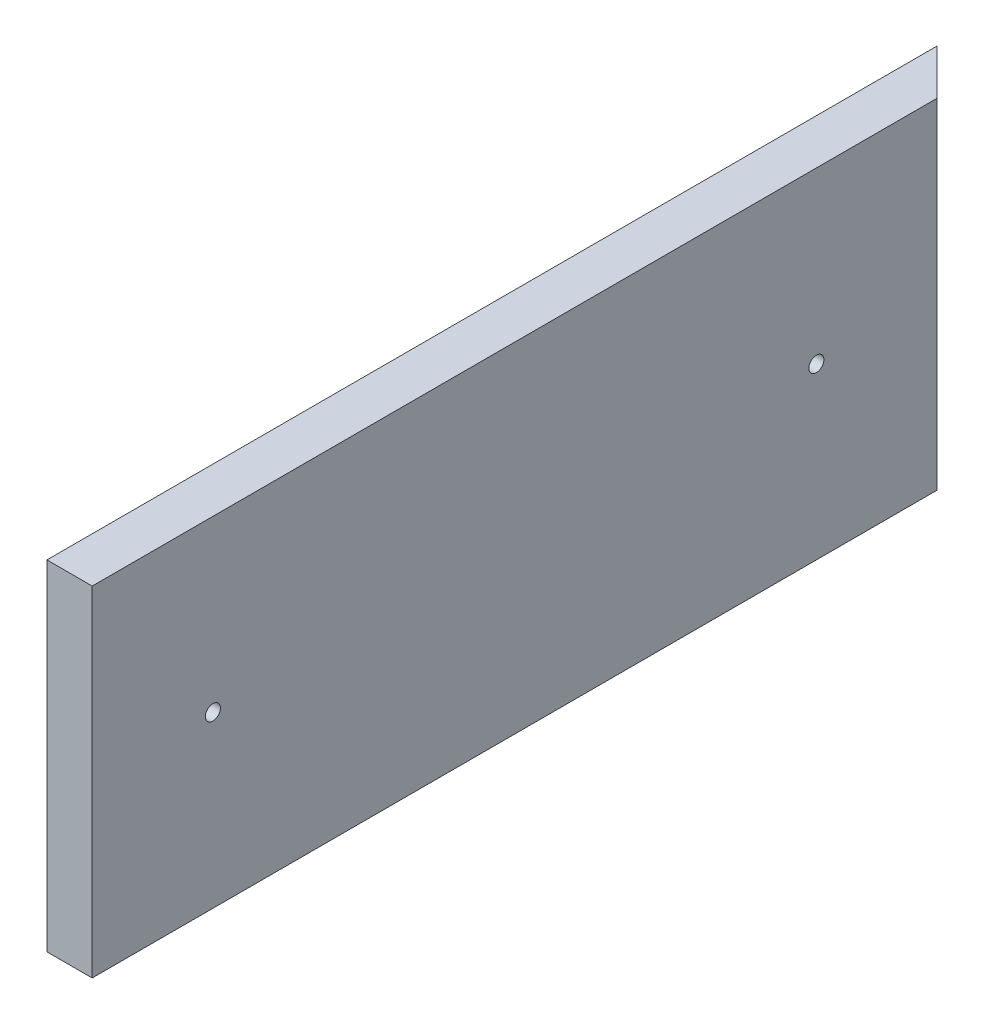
ISO-10303-21;
HEADER;
FILE_DESCRIPTION(('STEP AP214'),'2;1');
FILE_NAME('part.step','',(''),(''),'','','');
FILE_SCHEMA(('AUTOMOTIVE_DESIGN { 1 0 10303 214 1 1 1 1 }'));
ENDSEC;
DATA;
#1=APPLICATION_CONTEXT('core data for automotive mechanical design processes');
#2=APPLICATION_PROTOCOL_DEFINITION('international standard','automotive_design',2000,#1);
#3=PRODUCT_CONTEXT('',#1,'mechanical');
#4=PRODUCT('Part','Part','',(#3));
#5=PRODUCT_RELATED_PRODUCT_CATEGORY('part','',(#4));
#6=PRODUCT_DEFINITION_FORMATION('','',#4);
#7=PRODUCT_DEFINITION_CONTEXT('part definition',#1,'design');
#8=PRODUCT_DEFINITION('design','',#6,#7);
#9=PRODUCT_DEFINITION_SHAPE('','',#8);
#10=(LENGTH_UNIT() NAMED_UNIT(*) SI_UNIT(.MILLI.,.METRE.));
#11=(NAMED_UNIT(*) PLANE_ANGLE_UNIT() SI_UNIT($,.RADIAN.));
#12=(NAMED_UNIT(*) SI_UNIT($,.STERADIAN.) SOLID_ANGLE_UNIT());
#13=UNCERTAINTY_MEASURE_WITH_UNIT(LENGTH_MEASURE(1.E-05),#10,'distance_accuracy_value','');
#14=(GEOMETRIC_REPRESENTATION_CONTEXT(3) GLOBAL_UNCERTAINTY_ASSIGNED_CONTEXT((#13)) GLOBAL_UNIT_ASSIGNED_CONTEXT((#10,
#11,#12)) REPRESENTATION_CONTEXT('',''));
#15=CARTESIAN_POINT('',(0.,0.,0.));
#16=DIRECTION('',(0.,0.,1.));
#17=DIRECTION('',(1.,0.,0.));
#18=AXIS2_PLACEMENT_3D('',#15,#16,#17);
#19=CARTESIAN_POINT('',(0.,0.,711.2));
#20=DIRECTION('',(1.,0.,0.));
#21=DIRECTION('',(0.,0.,-1.));
#22=AXIS2_PLACEMENT_3D('',#19,#20,#21);
#23=PLANE('',#22);
#24=CARTESIAN_POINT('',(0.,142.875,609.6));
#25=DIRECTION('',(1.,0.,0.));
#26=DIRECTION('',(0.,0.,-1.));
#27=AXIS2_PLACEMENT_3D('',#24,#25,#26);
#28=CIRCLE('',#27,6.34999999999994);
#29=CARTESIAN_POINT('',(0.,142.875,603.25));
#30=VERTEX_POINT('',#29);
#31=EDGE_CURVE('E85',#30,#30,#28,.T.);
#32=ORIENTED_EDGE('',*,*,#31,.T.);
#33=EDGE_LOOP('',(#32));
#34=FACE_BOUND('',#33,.T.);
#35=CARTESIAN_POINT('',(0.,142.875,101.6));
#36=DIRECTION('',(1.,0.,0.));
#37=DIRECTION('',(0.,0.,-1.));
#38=AXIS2_PLACEMENT_3D('',#35,#36,#37);
#39=CIRCLE('',#38,6.34999999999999);
#40=CARTESIAN_POINT('',(0.,142.875,95.2500000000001));
#41=VERTEX_POINT('',#40);
#42=EDGE_CURVE('E110',#41,#41,#39,.T.);
#43=ORIENTED_EDGE('',*,*,#42,.T.);
#44=EDGE_LOOP('',(#43));
#45=FACE_BOUND('',#44,.T.);
#46=DIRECTION('',(0.,0.,-1.));
#47=VECTOR('',#46,1.);
#48=CARTESIAN_POINT('',(0.,285.75,711.2));
#49=LINE('',#48,#47);
#50=CARTESIAN_POINT('',(0.,285.75,711.2));
#51=VERTEX_POINT('',#50);
#52=CARTESIAN_POINT('',(0.,285.75,-38.0999999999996));
#53=VERTEX_POINT('',#52);
#54=EDGE_CURVE('E98',#51,#53,#49,.T.);
#55=ORIENTED_EDGE('',*,*,#54,.T.);
#56=DIRECTION('',(0.,1.,0.));
#57=VECTOR('',#56,1.);
#58=CARTESIAN_POINT('',(0.,-53.8815367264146,-38.0999999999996));
#59=LINE('',#58,#57);
#60=CARTESIAN_POINT('',(0.,0.,-38.0999999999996));
#61=VERTEX_POINT('',#60);
#62=EDGE_CURVE('E82',#61,#53,#59,.T.);
#63=ORIENTED_EDGE('',*,*,#62,.F.);
#64=DIRECTION('',(0.,0.,-1.));
#65=VECTOR('',#64,1.);
#66=CARTESIAN_POINT('',(0.,0.,711.2));
#67=LINE('',#66,#65);
#68=CARTESIAN_POINT('',(0.,0.,711.2));
#69=VERTEX_POINT('',#68);
#70=EDGE_CURVE('E11',#69,#61,#67,.T.);
#71=ORIENTED_EDGE('',*,*,#70,.F.);
#72=DIRECTION('',(0.,-1.,0.));
#73=VECTOR('',#72,1.);
#74=CARTESIAN_POINT('',(0.,0.,711.2));
#75=LINE('',#74,#73);
#76=EDGE_CURVE('E94',#51,#69,#75,.T.);
#77=ORIENTED_EDGE('',*,*,#76,.F.);
#78=EDGE_LOOP('',(#55,#63,#71,#77));
#79=FACE_BOUND('',#78,.T.);
#80=ADVANCED_FACE('F39',(#34,#45,#79),#23,.F.);
#81=CARTESIAN_POINT('',(0.,0.,711.2));
#82=DIRECTION('',(0.,1.,0.));
#83=DIRECTION('',(0.,0.,1.));
#84=AXIS2_PLACEMENT_3D('',#81,#82,#83);
#85=PLANE('',#84);
#86=ORIENTED_EDGE('',*,*,#70,.T.);
#87=DIRECTION('',(0.707106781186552,0.,0.707106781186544));
#88=VECTOR('',#87,1.);
#89=CARTESIAN_POINT('',(0.,0.,-38.0999999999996));
#90=LINE('',#89,#88);
#91=CARTESIAN_POINT('',(38.1,0.,0.));
#92=VERTEX_POINT('',#91);
#93=EDGE_CURVE('E95',#61,#92,#90,.T.);
#94=ORIENTED_EDGE('',*,*,#93,.T.);
#95=DIRECTION('',(0.,0.,-1.));
#96=VECTOR('',#95,1.);
#97=CARTESIAN_POINT('',(38.1,0.,711.2));
#98=LINE('',#97,#96);
#99=CARTESIAN_POINT('',(38.1,0.,711.2));
#100=VERTEX_POINT('',#99);
#101=EDGE_CURVE('E47',#100,#92,#98,.T.);
#102=ORIENTED_EDGE('',*,*,#101,.F.);
#103=DIRECTION('',(1.,0.,0.));
#104=VECTOR('',#103,1.);
#105=CARTESIAN_POINT('',(0.,0.,711.2));
#106=LINE('',#105,#104);
#107=EDGE_CURVE('E105',#69,#100,#106,.T.);
#108=ORIENTED_EDGE('',*,*,#107,.F.);
#109=EDGE_LOOP('',(#86,#94,#102,#108));
#110=FACE_BOUND('',#109,.T.);
#111=ADVANCED_FACE('F133',(#110),#85,.F.);
#112=CARTESIAN_POINT('',(38.1,0.,711.2));
#113=DIRECTION('',(-1.,0.,0.));
#114=DIRECTION('',(0.,0.,1.));
#115=AXIS2_PLACEMENT_3D('',#112,#113,#114);
#116=PLANE('',#115);
#117=CARTESIAN_POINT('',(38.1,142.875,609.6));
#118=DIRECTION('',(1.,0.,0.));
#119=DIRECTION('',(0.,0.,-1.));
#120=AXIS2_PLACEMENT_3D('',#117,#118,#119);
#121=CIRCLE('',#120,6.34999999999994);
#122=CARTESIAN_POINT('',(38.1,142.875,603.25));
#123=VERTEX_POINT('',#122);
#124=EDGE_CURVE('E116',#123,#123,#121,.T.);
#125=ORIENTED_EDGE('',*,*,#124,.F.);
#126=EDGE_LOOP('',(#125));
#127=FACE_BOUND('',#126,.T.);
#128=CARTESIAN_POINT('',(38.1,142.875,101.6));
#129=DIRECTION('',(1.,0.,0.));
#130=DIRECTION('',(0.,0.,-1.));
#131=AXIS2_PLACEMENT_3D('',#128,#129,#130);
#132=CIRCLE('',#131,6.34999999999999);
#133=CARTESIAN_POINT('',(38.1,142.875,95.2500000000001));
#134=VERTEX_POINT('',#133);
#135=EDGE_CURVE('E113',#134,#134,#132,.T.);
#136=ORIENTED_EDGE('',*,*,#135,.F.);
#137=EDGE_LOOP('',(#136));
#138=FACE_BOUND('',#137,.T.);
#139=DIRECTION('',(0.,1.,0.));
#140=VECTOR('',#139,1.);
#141=CARTESIAN_POINT('',(38.1,0.,0.));
#142=LINE('',#141,#140);
#143=CARTESIAN_POINT('',(38.1,285.75,0.));
#144=VERTEX_POINT('',#143);
#145=EDGE_CURVE('E79',#92,#144,#142,.T.);
#146=ORIENTED_EDGE('',*,*,#145,.T.);
#147=DIRECTION('',(0.,0.,-1.));
#148=VECTOR('',#147,1.);
#149=CARTESIAN_POINT('',(38.1,285.75,711.2));
#150=LINE('',#149,#148);
#151=CARTESIAN_POINT('',(38.1,285.75,711.2));
#152=VERTEX_POINT('',#151);
#153=EDGE_CURVE('E92',#152,#144,#150,.T.);
#154=ORIENTED_EDGE('',*,*,#153,.F.);
#155=DIRECTION('',(0.,1.,0.));
#156=VECTOR('',#155,1.);
#157=CARTESIAN_POINT('',(38.1,0.,711.2));
#158=LINE('',#157,#156);
#159=EDGE_CURVE('E103',#100,#152,#158,.T.);
#160=ORIENTED_EDGE('',*,*,#159,.F.);
#161=ORIENTED_EDGE('',*,*,#101,.T.);
#162=EDGE_LOOP('',(#146,#154,#160,#161));
#163=FACE_BOUND('',#162,.T.);
#164=ADVANCED_FACE('F90',(#127,#138,#163),#116,.F.);
#165=CARTESIAN_POINT('',(0.,285.75,711.2));
#166=DIRECTION('',(0.,-1.,0.));
#167=DIRECTION('',(0.,0.,-1.));
#168=AXIS2_PLACEMENT_3D('',#165,#166,#167);
#169=PLANE('',#168);
#170=ORIENTED_EDGE('',*,*,#153,.T.);
#171=DIRECTION('',(-0.707106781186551,0.,-0.707106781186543));
#172=VECTOR('',#171,1.);
#173=CARTESIAN_POINT('',(0.,285.75,-38.0999999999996));
#174=LINE('',#173,#172);
#175=EDGE_CURVE('E75',#144,#53,#174,.T.);
#176=ORIENTED_EDGE('',*,*,#175,.T.);
#177=ORIENTED_EDGE('',*,*,#54,.F.);
#178=DIRECTION('',(-1.,0.,0.));
#179=VECTOR('',#178,1.);
#180=CARTESIAN_POINT('',(0.,285.75,711.2));
#181=LINE('',#180,#179);
#182=EDGE_CURVE('E54',#152,#51,#181,.T.);
#183=ORIENTED_EDGE('',*,*,#182,.F.);
#184=EDGE_LOOP('',(#170,#176,#177,#183));
#185=FACE_BOUND('',#184,.T.);
#186=ADVANCED_FACE('F97',(#185),#169,.F.);
#187=CARTESIAN_POINT('',(0.,0.,711.2));
#188=DIRECTION('',(0.,0.,-1.));
#189=DIRECTION('',(-1.,0.,0.));
#190=AXIS2_PLACEMENT_3D('',#187,#188,#189);
#191=PLANE('',#190);
#192=ORIENTED_EDGE('',*,*,#76,.T.);
#193=ORIENTED_EDGE('',*,*,#107,.T.);
#194=ORIENTED_EDGE('',*,*,#159,.T.);
#195=ORIENTED_EDGE('',*,*,#182,.T.);
#196=EDGE_LOOP('',(#192,#193,#194,#195));
#197=FACE_BOUND('',#196,.T.);
#198=ADVANCED_FACE('F143',(#197),#191,.F.);
#199=CARTESIAN_POINT('',(0.,-53.8815367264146,-38.0999999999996));
#200=DIRECTION('',(0.707106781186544,0.,-0.707106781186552));
#201=DIRECTION('',(-0.707106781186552,0.,-0.707106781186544));
#202=AXIS2_PLACEMENT_3D('',#199,#200,#201);
#203=PLANE('',#202);
#204=ORIENTED_EDGE('',*,*,#93,.F.);
#205=ORIENTED_EDGE('',*,*,#62,.T.);
#206=ORIENTED_EDGE('',*,*,#175,.F.);
#207=ORIENTED_EDGE('',*,*,#145,.F.);
#208=EDGE_LOOP('',(#204,#205,#206,#207));
#209=FACE_BOUND('',#208,.T.);
#210=ADVANCED_FACE('F78',(#209),#203,.T.);
#211=CARTESIAN_POINT('',(0.,142.875,101.6));
#212=DIRECTION('',(1.,0.,0.));
#213=DIRECTION('',(0.,0.,-1.));
#214=AXIS2_PLACEMENT_3D('',#211,#212,#213);
#215=CYLINDRICAL_SURFACE('',#214,6.34999999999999);
#216=CARTESIAN_POINT('',(0.,142.875,95.2500000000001));
#217=CARTESIAN_POINT('',(0.396875,142.875,95.2500000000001));
#218=CARTESIAN_POINT('',(0.79375,142.875,95.2500000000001));
#219=CARTESIAN_POINT('',(1.5875,142.875,95.2500000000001));
#220=CARTESIAN_POINT('',(1.984375,142.875,95.2500000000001));
#221=CARTESIAN_POINT('',(2.778125,142.875,95.2500000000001));
#222=CARTESIAN_POINT('',(3.175,142.875,95.2500000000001));
#223=CARTESIAN_POINT('',(3.96875,142.875,95.2500000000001));
#224=CARTESIAN_POINT('',(4.365625,142.875,95.2500000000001));
#225=CARTESIAN_POINT('',(5.159375,142.875,95.2500000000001));
#226=CARTESIAN_POINT('',(5.55625,142.875,95.2500000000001));
#227=CARTESIAN_POINT('',(6.35,142.875,95.2500000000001));
#228=CARTESIAN_POINT('',(6.746875,142.875,95.2500000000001));
#229=CARTESIAN_POINT('',(7.540625,142.875,95.2500000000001));
#230=CARTESIAN_POINT('',(7.9375,142.875,95.2500000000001));
#231=CARTESIAN_POINT('',(8.73125,142.875,95.2500000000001));
#232=CARTESIAN_POINT('',(9.128125,142.875,95.2500000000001));
#233=CARTESIAN_POINT('',(9.921875,142.875,95.2500000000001));
#234=CARTESIAN_POINT('',(10.31875,142.875,95.2500000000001));
#235=CARTESIAN_POINT('',(11.1125,142.875,95.2500000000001));
#236=CARTESIAN_POINT('',(11.509375,142.875,95.2500000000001));
#237=CARTESIAN_POINT('',(12.303125,142.875,95.2500000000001));
#238=CARTESIAN_POINT('',(12.7,142.875,95.2500000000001));
#239=CARTESIAN_POINT('',(13.49375,142.875,95.2500000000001));
#240=CARTESIAN_POINT('',(13.890625,142.875,95.2500000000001));
#241=CARTESIAN_POINT('',(14.684375,142.875,95.2500000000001));
#242=CARTESIAN_POINT('',(15.08125,142.875,95.2500000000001));
#243=CARTESIAN_POINT('',(15.875,142.875,95.2500000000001));
#244=CARTESIAN_POINT('',(16.271875,142.875,95.2500000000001));
#245=CARTESIAN_POINT('',(17.065625,142.875,95.2500000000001));
#246=CARTESIAN_POINT('',(17.4625,142.875,95.2500000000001));
#247=CARTESIAN_POINT('',(18.25625,142.875,95.2500000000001));
#248=CARTESIAN_POINT('',(18.653125,142.875,95.2500000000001));
#249=CARTESIAN_POINT('',(19.446875,142.875,95.2500000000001));
#250=CARTESIAN_POINT('',(19.84375,142.875,95.2500000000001));
#251=CARTESIAN_POINT('',(20.6375,142.875,95.2500000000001));
#252=CARTESIAN_POINT('',(21.034375,142.875,95.2500000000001));
#253=CARTESIAN_POINT('',(21.828125,142.875,95.2500000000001));
#254=CARTESIAN_POINT('',(22.225,142.875,95.2500000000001));
#255=CARTESIAN_POINT('',(23.01875,142.875,95.2500000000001));
#256=CARTESIAN_POINT('',(23.415625,142.875,95.2500000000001));
#257=CARTESIAN_POINT('',(24.209375,142.875,95.2500000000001));
#258=CARTESIAN_POINT('',(24.60625,142.875,95.2500000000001));
#259=CARTESIAN_POINT('',(25.4,142.875,95.2500000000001));
#260=CARTESIAN_POINT('',(25.796875,142.875,95.2500000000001));
#261=CARTESIAN_POINT('',(26.590625,142.875,95.2500000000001));
#262=CARTESIAN_POINT('',(26.9875,142.875,95.2500000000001));
#263=CARTESIAN_POINT('',(27.78125,142.875,95.2500000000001));
#264=CARTESIAN_POINT('',(28.178125,142.875,95.2500000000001));
#265=CARTESIAN_POINT('',(28.971875,142.875,95.2500000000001));
#266=CARTESIAN_POINT('',(29.36875,142.875,95.2500000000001));
#267=CARTESIAN_POINT('',(30.1625,142.875,95.2500000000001));
#268=CARTESIAN_POINT('',(30.559375,142.875,95.2500000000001));
#269=CARTESIAN_POINT('',(31.353125,142.875,95.2500000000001));
#270=CARTESIAN_POINT('',(31.75,142.875,95.2500000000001));
#271=CARTESIAN_POINT('',(32.54375,142.875,95.2500000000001));
#272=CARTESIAN_POINT('',(32.940625,142.875,95.2500000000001));
#273=CARTESIAN_POINT('',(33.734375,142.875,95.2500000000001));
#274=CARTESIAN_POINT('',(34.13125,142.875,95.2500000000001));
#275=CARTESIAN_POINT('',(34.925,142.875,95.2500000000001));
#276=CARTESIAN_POINT('',(35.321875,142.875,95.2500000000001));
#277=CARTESIAN_POINT('',(36.115625,142.875,95.2500000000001));
#278=CARTESIAN_POINT('',(36.5125,142.875,95.2500000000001));
#279=CARTESIAN_POINT('',(37.30625,142.875,95.2500000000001));
#280=CARTESIAN_POINT('',(37.703125,142.875,95.2500000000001));
#281=CARTESIAN_POINT('',(38.1,142.875,95.2500000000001));
#282=B_SPLINE_CURVE_WITH_KNOTS('',3,(#216,#217,#218,#219,#220,#221,#222,#223,#224,#225,#226,
#227,#228,#229,#230,#231,#232,#233,#234,#235,#236,#237,#238,#239,#240,#241,#242,#243,#244,#245,
#246,#247,#248,#249,#250,#251,#252,#253,#254,#255,#256,#257,#258,#259,#260,#261,#262,#263,#264,
#265,#266,#267,#268,#269,#270,#271,#272,#273,#274,#275,#276,#277,#278,#279,#280,#281),
.UNSPECIFIED.,.F.,.F.,(4,2,2,2,2,2,2,2,2,2,2,2,2,2,2,2,2,2,2,2,2,2,2,2,2,2,2,2,2,2,2,2,4),(0.,
1.190625,2.38125,3.571875,4.7625,5.953125,7.14375,8.334375,9.525,10.715625,11.90625,13.096875,
14.2875,15.478125,16.66875,17.859375,19.05,20.240625,21.43125,22.621875,23.8125,25.003125,
26.19375,27.384375,28.575,29.765625,30.95625,32.146875,33.3375,34.528125,35.71875,36.909375,
38.1),.UNSPECIFIED.);
#283=EDGE_CURVE('BSEAM127',#41,#134,#282,.T.);
#284=ORIENTED_EDGE('',*,*,#42,.F.);
#285=ORIENTED_EDGE('',*,*,#135,.T.);
#286=ORIENTED_EDGE('',*,*,#283,.T.);
#287=ORIENTED_EDGE('',*,*,#283,.F.);
#288=EDGE_LOOP('',(#284,#286,#285,#287));
#289=FACE_BOUND('',#288,.T.);
#290=ADVANCED_FACE('F127',(#289),#215,.F.);
#291=CARTESIAN_POINT('',(0.,142.875,609.6));
#292=DIRECTION('',(1.,0.,0.));
#293=DIRECTION('',(0.,0.,-1.));
#294=AXIS2_PLACEMENT_3D('',#291,#292,#293);
#295=CYLINDRICAL_SURFACE('',#294,6.34999999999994);
#296=CARTESIAN_POINT('',(0.,142.875,603.25));
#297=CARTESIAN_POINT('',(0.396875,142.875,603.25));
#298=CARTESIAN_POINT('',(0.79375,142.875,603.25));
#299=CARTESIAN_POINT('',(1.5875,142.875,603.25));
#300=CARTESIAN_POINT('',(1.984375,142.875,603.25));
#301=CARTESIAN_POINT('',(2.778125,142.875,603.25));
#302=CARTESIAN_POINT('',(3.175,142.875,603.25));
#303=CARTESIAN_POINT('',(3.96875,142.875,603.25));
#304=CARTESIAN_POINT('',(4.365625,142.875,603.25));
#305=CARTESIAN_POINT('',(5.159375,142.875,603.25));
#306=CARTESIAN_POINT('',(5.55625,142.875,603.25));
#307=CARTESIAN_POINT('',(6.35,142.875,603.25));
#308=CARTESIAN_POINT('',(6.746875,142.875,603.25));
#309=CARTESIAN_POINT('',(7.540625,142.875,603.25));
#310=CARTESIAN_POINT('',(7.9375,142.875,603.25));
#311=CARTESIAN_POINT('',(8.73125,142.875,603.25));
#312=CARTESIAN_POINT('',(9.128125,142.875,603.25));
#313=CARTESIAN_POINT('',(9.921875,142.875,603.25));
#314=CARTESIAN_POINT('',(10.31875,142.875,603.25));
#315=CARTESIAN_POINT('',(11.1125,142.875,603.25));
#316=CARTESIAN_POINT('',(11.509375,142.875,603.25));
#317=CARTESIAN_POINT('',(12.303125,142.875,603.25));
#318=CARTESIAN_POINT('',(12.7,142.875,603.25));
#319=CARTESIAN_POINT('',(13.49375,142.875,603.25));
#320=CARTESIAN_POINT('',(13.890625,142.875,603.25));
#321=CARTESIAN_POINT('',(14.684375,142.875,603.25));
#322=CARTESIAN_POINT('',(15.08125,142.875,603.25));
#323=CARTESIAN_POINT('',(15.875,142.875,603.25));
#324=CARTESIAN_POINT('',(16.271875,142.875,603.25));
#325=CARTESIAN_POINT('',(17.065625,142.875,603.25));
#326=CARTESIAN_POINT('',(17.4625,142.875,603.25));
#327=CARTESIAN_POINT('',(18.25625,142.875,603.25));
#328=CARTESIAN_POINT('',(18.653125,142.875,603.25));
#329=CARTESIAN_POINT('',(19.446875,142.875,603.25));
#330=CARTESIAN_POINT('',(19.84375,142.875,603.25));
#331=CARTESIAN_POINT('',(20.6375,142.875,603.25));
#332=CARTESIAN_POINT('',(21.034375,142.875,603.25));
#333=CARTESIAN_POINT('',(21.828125,142.875,603.25));
#334=CARTESIAN_POINT('',(22.225,142.875,603.25));
#335=CARTESIAN_POINT('',(23.01875,142.875,603.25));
#336=CARTESIAN_POINT('',(23.415625,142.875,603.25));
#337=CARTESIAN_POINT('',(24.209375,142.875,603.25));
#338=CARTESIAN_POINT('',(24.60625,142.875,603.25));
#339=CARTESIAN_POINT('',(25.4,142.875,603.25));
#340=CARTESIAN_POINT('',(25.796875,142.875,603.25));
#341=CARTESIAN_POINT('',(26.590625,142.875,603.25));
#342=CARTESIAN_POINT('',(26.9875,142.875,603.25));
#343=CARTESIAN_POINT('',(27.78125,142.875,603.25));
#344=CARTESIAN_POINT('',(28.178125,142.875,603.25));
#345=CARTESIAN_POINT('',(28.971875,142.875,603.25));
#346=CARTESIAN_POINT('',(29.36875,142.875,603.25));
#347=CARTESIAN_POINT('',(30.1625,142.875,603.25));
#348=CARTESIAN_POINT('',(30.559375,142.875,603.25));
#349=CARTESIAN_POINT('',(31.353125,142.875,603.25));
#350=CARTESIAN_POINT('',(31.75,142.875,603.25));
#351=CARTESIAN_POINT('',(32.54375,142.875,603.25));
#352=CARTESIAN_POINT('',(32.940625,142.875,603.25));
#353=CARTESIAN_POINT('',(33.734375,142.875,603.25));
#354=CARTESIAN_POINT('',(34.13125,142.875,603.25));
#355=CARTESIAN_POINT('',(34.925,142.875,603.25));
#356=CARTESIAN_POINT('',(35.321875,142.875,603.25));
#357=CARTESIAN_POINT('',(36.115625,142.875,603.25));
#358=CARTESIAN_POINT('',(36.5125,142.875,603.25));
#359=CARTESIAN_POINT('',(37.30625,142.875,603.25));
#360=CARTESIAN_POINT('',(37.703125,142.875,603.25));
#361=CARTESIAN_POINT('',(38.1,142.875,603.25));
#362=B_SPLINE_CURVE_WITH_KNOTS('',3,(#296,#297,#298,#299,#300,#301,#302,#303,#304,#305,#306,
#307,#308,#309,#310,#311,#312,#313,#314,#315,#316,#317,#318,#319,#320,#321,#322,#323,#324,#325,
#326,#327,#328,#329,#330,#331,#332,#333,#334,#335,#336,#337,#338,#339,#340,#341,#342,#343,#344,
#345,#346,#347,#348,#349,#350,#351,#352,#353,#354,#355,#356,#357,#358,#359,#360,#361),
.UNSPECIFIED.,.F.,.F.,(4,2,2,2,2,2,2,2,2,2,2,2,2,2,2,2,2,2,2,2,2,2,2,2,2,2,2,2,2,2,2,2,4),(0.,
1.190625,2.38125,3.571875,4.7625,5.953125,7.14375,8.334375,9.525,10.715625,11.90625,13.096875,
14.2875,15.478125,16.66875,17.859375,19.05,20.240625,21.43125,22.621875,23.8125,25.003125,
26.19375,27.384375,28.575,29.765625,30.95625,32.146875,33.3375,34.528125,35.71875,36.909375,
38.1),.UNSPECIFIED.);
#363=EDGE_CURVE('BSEAM124',#30,#123,#362,.T.);
#364=ORIENTED_EDGE('',*,*,#31,.F.);
#365=ORIENTED_EDGE('',*,*,#124,.T.);
#366=ORIENTED_EDGE('',*,*,#363,.T.);
#367=ORIENTED_EDGE('',*,*,#363,.F.);
#368=EDGE_LOOP('',(#364,#366,#365,#367));
#369=FACE_BOUND('',#368,.T.);
#370=ADVANCED_FACE('F124',(#369),#295,.F.);
#371=CLOSED_SHELL('',(#80,#111,#164,#186,#198,#210,#290,#370));
#372=MANIFOLD_SOLID_BREP('B2',#371);
#373=ADVANCED_BREP_SHAPE_REPRESENTATION('',(#18,#372),#14);
#374=SHAPE_DEFINITION_REPRESENTATION(#9,#373);
ENDSEC;
END-ISO-10303-21;
